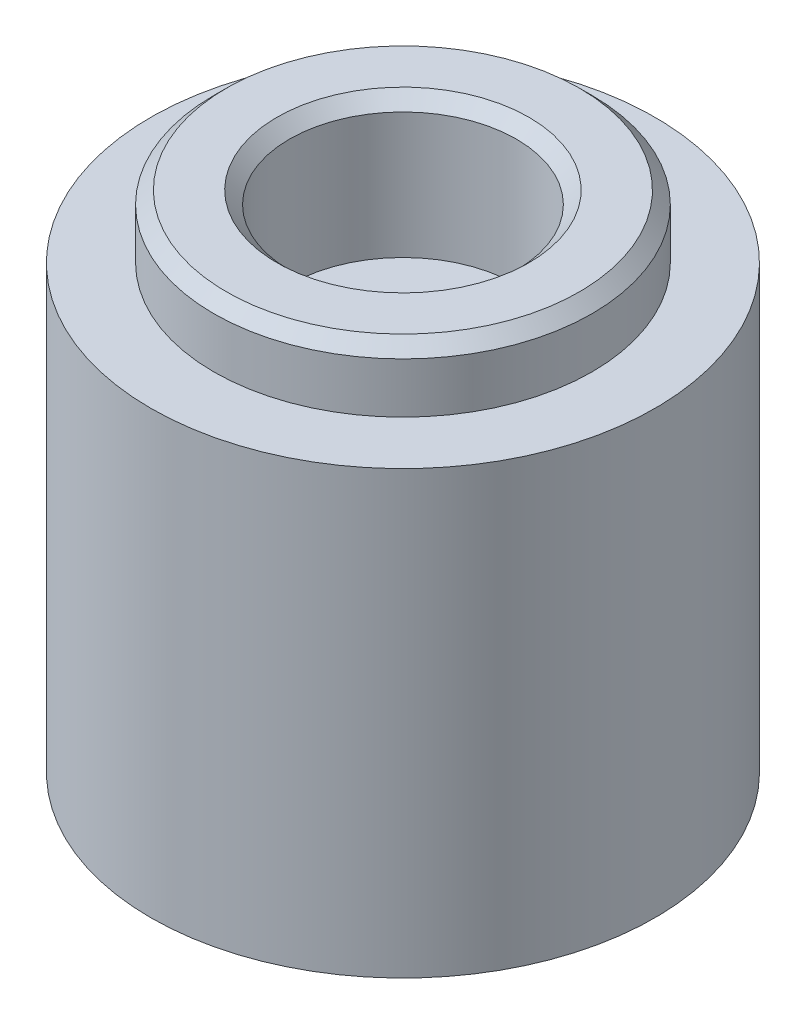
from build123d import *

# Parameters (mm, degrees)
CHANFREIN1_SIZE = 1


with BuildPart() as part:
    # Esquisse1 → Base-R_volution (revolve)
    with BuildSketch(Plane.XY, mode=Mode.PRIVATE) as base_r_volution_sk:
        Polygon((5.5, 35), (5.5, 0), (9, 0), (9, 6), (20, 6), (20, 41), (15, 41), (15, 46), (9, 46), (9, 35), align=None)
    revolve(base_r_volution_sk.sketch.rotate(Axis((0, 30, 0), (0, -1, 0)), 90), axis=Axis((0, 30, 0), (0, -1, 0)))

    # Chanfrein1
    chanfrein1_edges = [part.edges().sort_by_distance(p)[0] for p in [
        (0, 0, -5.5),
        (0, 0, -9),
        (0, 46, -15),
        (0, 46, -9),
    ]]
    chamfer(chanfrein1_edges, length=CHANFREIN1_SIZE)


solid = part.part
